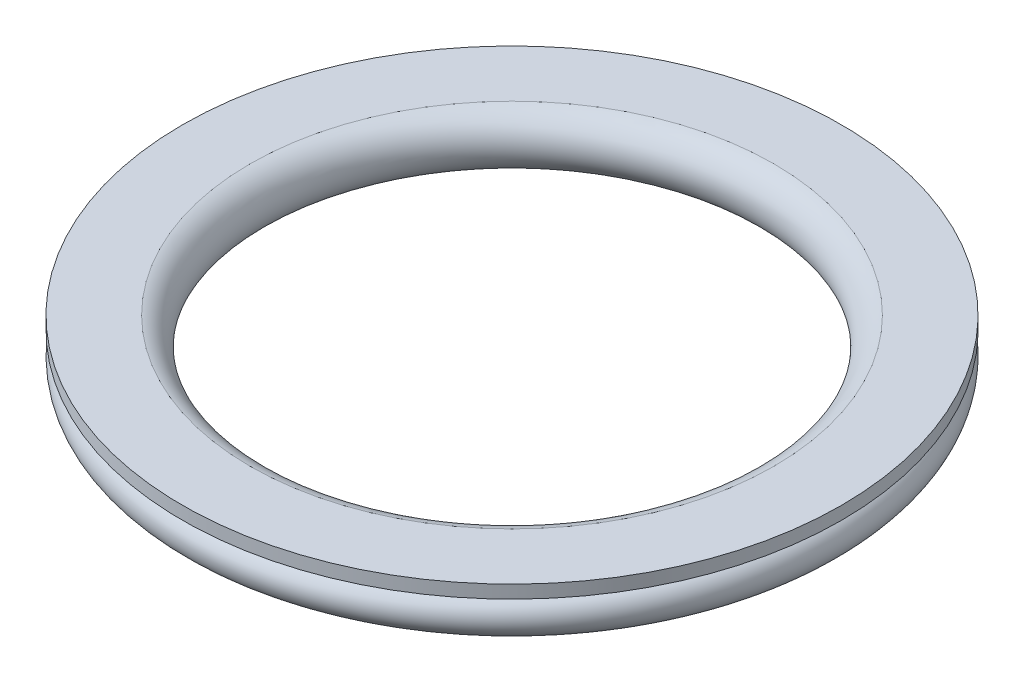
from build123d import *


with BuildPart() as part:
    # Esquisse1 → Base-R_volution (revolve)
    with BuildSketch(Plane.XY):
        with BuildLine():
            Line((-108.343696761, -10.27363525), (-108.343696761, -9.02363525))
            Line((-108.343696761, -9.02363525), (-101.849499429, -9.02363525))
            ThreePointArc((-101.849499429, -9.02363525), (-99.983062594, -12.88238357), (-104.192840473, -13.689412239))
            Line((-104.192840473, -13.689412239), (-106.078739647, -12.013378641))
            ThreePointArc((-106.078739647, -12.013378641), (-107.156469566, -12.277674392), (-106.526465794, -13.19115634))
            Line((-106.526465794, -13.19115634), (-106.078739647, -13.19115634))
            Line((-106.078739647, -13.19115634), (-106.078739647, -14.192336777))
            ThreePointArc((-106.078739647, -14.192336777), (-108.282428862, -11.914683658), (-105.250604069, -10.991651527))
            Line((-105.250604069, -10.991651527), (-103.250117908, -12.769520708))
            ThreePointArc((-103.250117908, -12.769520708), (-100.999670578, -12.391470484), (-101.849499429, -10.27363525))
            Line((-101.849499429, -10.27363525), (-108.343696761, -10.27363525))
        make_face()
    revolve(axis=Axis((-76.693696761, 9.316072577, 0), (0, -1, 0)))


solid = part.part
